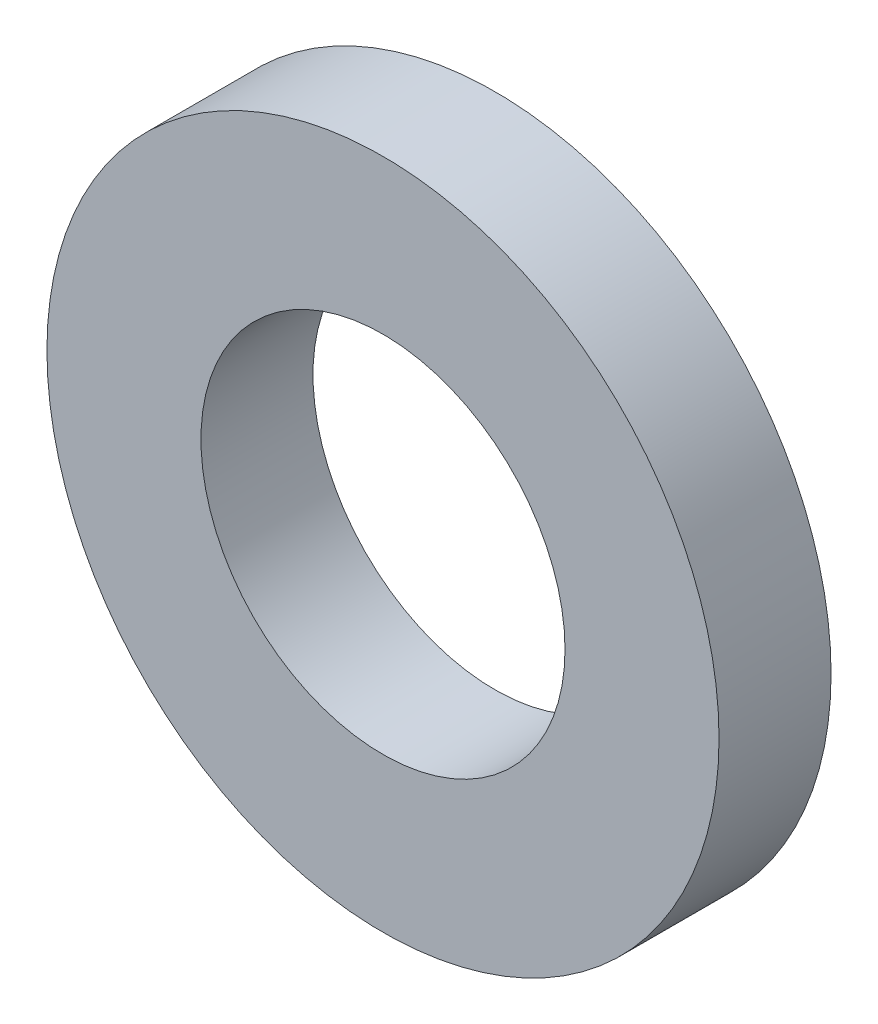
from build123d import *

# Parameters (mm, degrees)
SKETCH1_R      = 38.1
SKETCH1_R_2    = 20.6375
EXTRUDE1_DEPTH = 12.7


with BuildPart() as part:
    # Sketch1 → Extrude1 (new body)
    with BuildSketch(Plane.XY):
        Circle(SKETCH1_R)
        Circle(SKETCH1_R_2, mode=Mode.SUBTRACT)
    extrude(amount=EXTRUDE1_DEPTH)


solid = part.part
